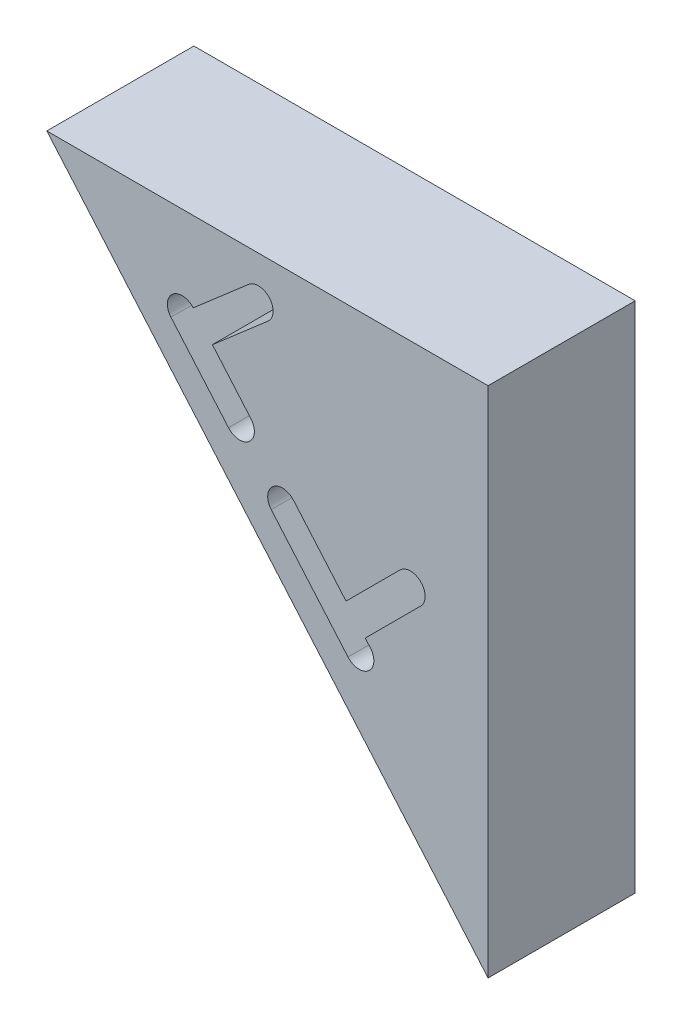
from build123d import *

# Parameters (mm, degrees)
BOSS_EXTRU_1_DEPTH = 5


with BuildPart() as part:
    # Esquisse1 → Boss.-Extru.1 (new body)
    with BuildSketch(Plane.XY):
        Polygon((0, -17.435595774), (0, 0), (-15, 0), align=None)
        with BuildLine():
            ThreePointArc((-10.780700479, -3.374046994), (-10.728488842, -2.669559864), (-10.02390156, -2.720402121))
            Line((-10.02390156, -2.720402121), (-8.136234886, -1.083613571))
            ThreePointArc((-8.136234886, -1.083613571), (-7.430912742, -1.133819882), (-7.481119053, -1.839142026))
            Line((-7.481119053, -1.839142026), (-9.371719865, -3.478474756))
            Line((-9.371719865, -3.478474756), (-8.066109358, -4.996081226))
            ThreePointArc((-8.066109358, -4.996081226), (-8.119057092, -5.701202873), (-8.824178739, -5.648255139))
            Line((-8.824178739, -5.648255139), (-10.780700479, -3.374046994))
        make_face(mode=Mode.SUBTRACT)
        with BuildLine():
            Line((-6.613091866, -6.682049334), (-4.829172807, -8.755628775))
            Line((-4.829172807, -8.755628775), (-2.993947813, -6.920403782))
            ThreePointArc((-2.993947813, -6.920403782), (-2.286841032, -6.920403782), (-2.286841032, -7.627510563))
            Line((-2.286841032, -7.627510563), (-4.175162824, -9.515832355))
            Line((-4.175162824, -9.515832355), (-4.004396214, -9.71432686))
            ThreePointArc((-4.004396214, -9.71432686), (-4.057343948, -10.419448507), (-4.762465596, -10.366500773))
            Line((-4.762465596, -10.366500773), (-5.235751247, -9.816366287))
            Line((-5.235751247, -9.816366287), (-7.371161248, -7.334223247))
            ThreePointArc((-7.371161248, -7.334223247), (-7.318213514, -6.6291016), (-6.613091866, -6.682049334))
        make_face(mode=Mode.SUBTRACT)
    extrude(amount=BOSS_EXTRU_1_DEPTH)


solid = part.part
